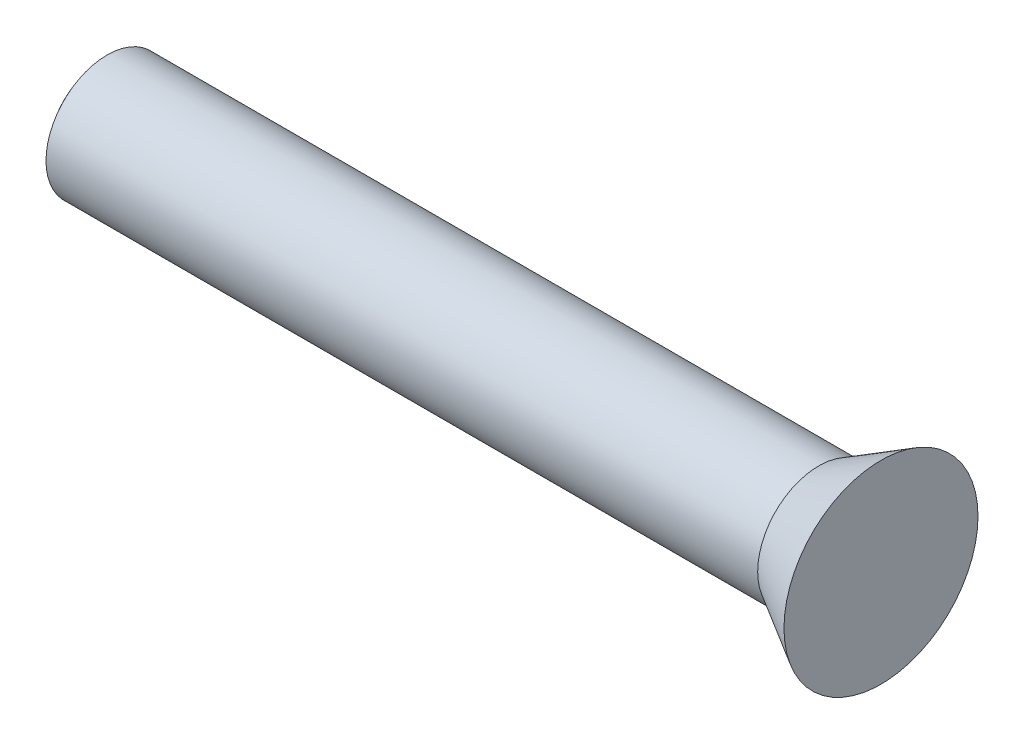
ISO-10303-21;
HEADER;
FILE_DESCRIPTION(('STEP AP214'),'2;1');
FILE_NAME('part.step','',(''),(''),'','','');
FILE_SCHEMA(('AUTOMOTIVE_DESIGN { 1 0 10303 214 1 1 1 1 }'));
ENDSEC;
DATA;
#1=APPLICATION_CONTEXT('core data for automotive mechanical design processes');
#2=APPLICATION_PROTOCOL_DEFINITION('international standard','automotive_design',2000,#1);
#3=PRODUCT_CONTEXT('',#1,'mechanical');
#4=PRODUCT('Part','Part','',(#3));
#5=PRODUCT_RELATED_PRODUCT_CATEGORY('part','',(#4));
#6=PRODUCT_DEFINITION_FORMATION('','',#4);
#7=PRODUCT_DEFINITION_CONTEXT('part definition',#1,'design');
#8=PRODUCT_DEFINITION('design','',#6,#7);
#9=PRODUCT_DEFINITION_SHAPE('','',#8);
#10=(LENGTH_UNIT() NAMED_UNIT(*) SI_UNIT(.MILLI.,.METRE.));
#11=(NAMED_UNIT(*) PLANE_ANGLE_UNIT() SI_UNIT($,.RADIAN.));
#12=(NAMED_UNIT(*) SI_UNIT($,.STERADIAN.) SOLID_ANGLE_UNIT());
#13=UNCERTAINTY_MEASURE_WITH_UNIT(LENGTH_MEASURE(1.E-05),#10,'distance_accuracy_value','');
#14=(GEOMETRIC_REPRESENTATION_CONTEXT(3) GLOBAL_UNCERTAINTY_ASSIGNED_CONTEXT((#13)) GLOBAL_UNIT_ASSIGNED_CONTEXT((#10,
#11,#12)) REPRESENTATION_CONTEXT('',''));
#15=CARTESIAN_POINT('',(0.,0.,0.));
#16=DIRECTION('',(0.,0.,1.));
#17=DIRECTION('',(1.,0.,0.));
#18=AXIS2_PLACEMENT_3D('',#15,#16,#17);
#19=CARTESIAN_POINT('',(1.27,0.,0.));
#20=DIRECTION('',(-1.,0.,0.));
#21=DIRECTION('',(0.,1.,0.));
#22=AXIS2_PLACEMENT_3D('',#19,#20,#21);
#23=SPHERICAL_SURFACE('',#22,1.27);
#24=CARTESIAN_POINT('',(0.283643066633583,0.,0.));
#25=DIRECTION('',(-1.,0.,0.));
#26=DIRECTION('',(0.,0.,1.));
#27=AXIS2_PLACEMENT_3D('',#24,#25,#26);
#28=CIRCLE('',#27,0.799999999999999);
#29=CARTESIAN_POINT('',(0.283643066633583,0.,0.799999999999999));
#30=VERTEX_POINT('',#29);
#31=EDGE_CURVE('E10',#30,#30,#28,.T.);
#32=ORIENTED_EDGE('',*,*,#31,.T.);
#33=EDGE_LOOP('',(#32));
#34=FACE_BOUND('',#33,.T.);
#35=ADVANCED_FACE('F28',(#34),#23,.T.);
#36=CARTESIAN_POINT('',(0.,0.,0.));
#37=DIRECTION('',(-1.,0.,0.));
#38=DIRECTION('',(0.,0.,1.));
#39=AXIS2_PLACEMENT_3D('',#36,#37,#38);
#40=CYLINDRICAL_SURFACE('',#39,0.799999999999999);
#41=ORIENTED_EDGE('',*,*,#31,.F.);
#42=EDGE_LOOP('',(#41));
#43=FACE_BOUND('',#42,.T.);
#44=CARTESIAN_POINT('',(9.59993612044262,0.,0.));
#45=DIRECTION('',(-1.,0.,0.));
#46=DIRECTION('',(0.,0.,1.));
#47=AXIS2_PLACEMENT_3D('',#44,#45,#46);
#48=CIRCLE('',#47,0.8);
#49=CARTESIAN_POINT('',(9.59993612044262,0.,0.8));
#50=VERTEX_POINT('',#49);
#51=EDGE_CURVE('E34',#50,#50,#48,.T.);
#52=ORIENTED_EDGE('',*,*,#51,.T.);
#53=EDGE_LOOP('',(#52));
#54=FACE_BOUND('',#53,.T.);
#55=ADVANCED_FACE('F53',(#43,#54),#40,.T.);
#56=CARTESIAN_POINT('',(10.414,0.,0.));
#57=DIRECTION('',(1.,0.,0.));
#58=DIRECTION('',(0.,0.,-1.));
#59=AXIS2_PLACEMENT_3D('',#56,#57,#58);
#60=CONICAL_SURFACE('',#59,1.27,0.523598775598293);
#61=ORIENTED_EDGE('',*,*,#51,.F.);
#62=EDGE_LOOP('',(#61));
#63=FACE_BOUND('',#62,.T.);
#64=CARTESIAN_POINT('',(10.414,0.,0.));
#65=DIRECTION('',(-1.,0.,0.));
#66=DIRECTION('',(0.,0.,1.));
#67=AXIS2_PLACEMENT_3D('',#64,#65,#66);
#68=CIRCLE('',#67,1.27);
#69=CARTESIAN_POINT('',(10.414,0.,1.27));
#70=VERTEX_POINT('',#69);
#71=EDGE_CURVE('E38',#70,#70,#68,.T.);
#72=ORIENTED_EDGE('',*,*,#71,.T.);
#73=EDGE_LOOP('',(#72));
#74=FACE_BOUND('',#73,.T.);
#75=ADVANCED_FACE('F45',(#63,#74),#60,.T.);
#76=CARTESIAN_POINT('',(10.414,0.,0.));
#77=DIRECTION('',(-1.,0.,0.));
#78=DIRECTION('',(0.,0.,1.));
#79=AXIS2_PLACEMENT_3D('',#76,#77,#78);
#80=PLANE('',#79);
#81=ORIENTED_EDGE('',*,*,#71,.F.);
#82=EDGE_LOOP('',(#81));
#83=FACE_BOUND('',#82,.T.);
#84=ADVANCED_FACE('F47',(#83),#80,.F.);
#85=CLOSED_SHELL('',(#35,#55,#75,#84));
#86=MANIFOLD_SOLID_BREP('B2',#85);
#87=ADVANCED_BREP_SHAPE_REPRESENTATION('',(#18,#86),#14);
#88=SHAPE_DEFINITION_REPRESENTATION(#9,#87);
ENDSEC;
END-ISO-10303-21;
